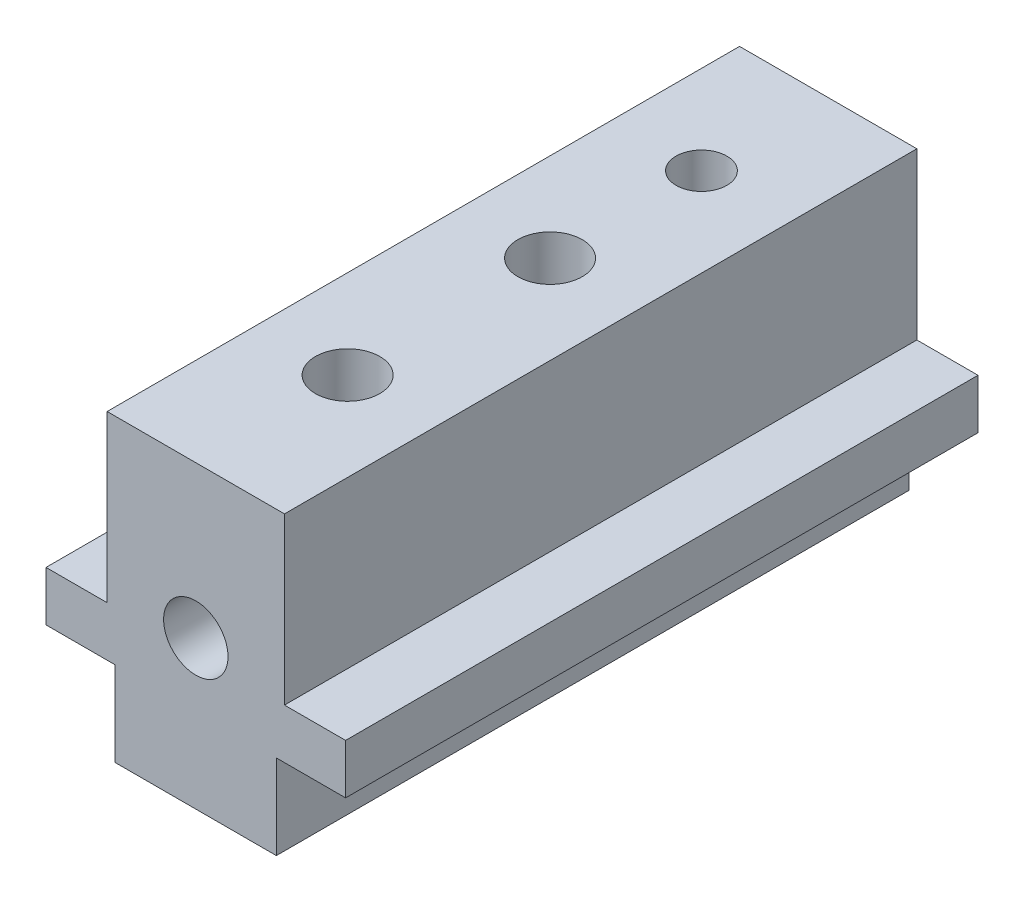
from build123d import *

# Parameters (mm, degrees)
SKETCH1_W                    = 18.796
SKETCH1_H                    = 39.6748
EXTRUDE1_DEPTH               = 9.4107
SKETCH2_W                    = 4.3434
SKETCH2_H                    = 5.3086
SKETCH2_W_2                  = 3.8354
SKETCH2_H_2                  = 10.3886
CUT_EXTRUDE1_DEPTH           = 42.844634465
F_10_32_FINGER_MOUNT_D       = 4.0386
F_10_32_FINGER_MOUNT_DEPTH   = 11.8872
F_10_32_FINGER_MOUNT_TIP     = 1.213317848
F_10_32_FINGER_MOUNT_2_D     = 4.0386
F_10_32_FINGER_MOUNT_2_DEPTH = 11.8869968
F_10_32_FINGER_MOUNT_2_TIP   = 1.213317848
SKETCH7_R                    = 1.59385
F_1_8_DOWEL_SLIP_FIT_DEPTH   = 6.35


with BuildPart() as part:
    # Sketch1 → Extrude1 (new, symmetric)
    with BuildSketch(Plane(origin=(0, 0, 0), x_dir=(1, 0, 0), z_dir=(0, 1, 0))):
        Rectangle(SKETCH1_W, SKETCH1_H)
    extrude(amount=EXTRUDE1_DEPTH, both=True)

    # Sketch2 → Cut-Extrude1 (cut, through all)
    with BuildSketch(Plane.XY.offset(19.8374)):
        with Locations((7.2263, -6.7564)):
            Rectangle(SKETCH2_W, SKETCH2_H)
        with Locations((-7.4803, 4.2164)):
            Rectangle(SKETCH2_W_2, SKETCH2_H_2)
        with Locations((7.4803, 4.2164)):
            Rectangle(SKETCH2_W_2, SKETCH2_H_2)
        with Locations((-7.2263, -6.7564)):
            Rectangle(SKETCH2_W, SKETCH2_H)
    extrude(amount=-CUT_EXTRUDE1_DEPTH, mode=Mode.SUBTRACT)

    # 10-32 _Finger Mount
    with Locations(Plane(origin=(0, 9.4107, 0), x_dir=(-1, 0, 0), z_dir=(0, 1, 0))):
        with Locations((0, 10.3124), (0, -2.3876)):
            Hole(F_10_32_FINGER_MOUNT_D / 2, depth=F_10_32_FINGER_MOUNT_DEPTH)
            with Locations((0, 0, -(F_10_32_FINGER_MOUNT_DEPTH + F_10_32_FINGER_MOUNT_TIP / 2))):  # 118° drill point
                Cone(0, F_10_32_FINGER_MOUNT_D / 2, F_10_32_FINGER_MOUNT_TIP, mode=Mode.SUBTRACT)

    # 10-32 _Finger Mount 2
    with Locations(Plane.XY.offset(19.8374)):
        with Locations((0, -0.1143)):
            Hole(F_10_32_FINGER_MOUNT_2_D / 2, depth=F_10_32_FINGER_MOUNT_2_DEPTH)
            with Locations((0, 0, -(F_10_32_FINGER_MOUNT_2_DEPTH + F_10_32_FINGER_MOUNT_2_TIP / 2))):  # 118° drill point
                Cone(0, F_10_32_FINGER_MOUNT_2_D / 2, F_10_32_FINGER_MOUNT_2_TIP, mode=Mode.SUBTRACT)

    # Sketch7 → 1_8 Dowel Slip Fit (cut)
    with BuildSketch(Plane(origin=(0, 9.4107, 0), x_dir=(-1, 0, 0), z_dir=(0, 1, 0))):
        with Locations(Location((0, -11.8872, 0), (0, 0, 90))):
            Circle(SKETCH7_R)
    extrude(amount=-F_1_8_DOWEL_SLIP_FIT_DEPTH, mode=Mode.SUBTRACT)


solid = part.part
